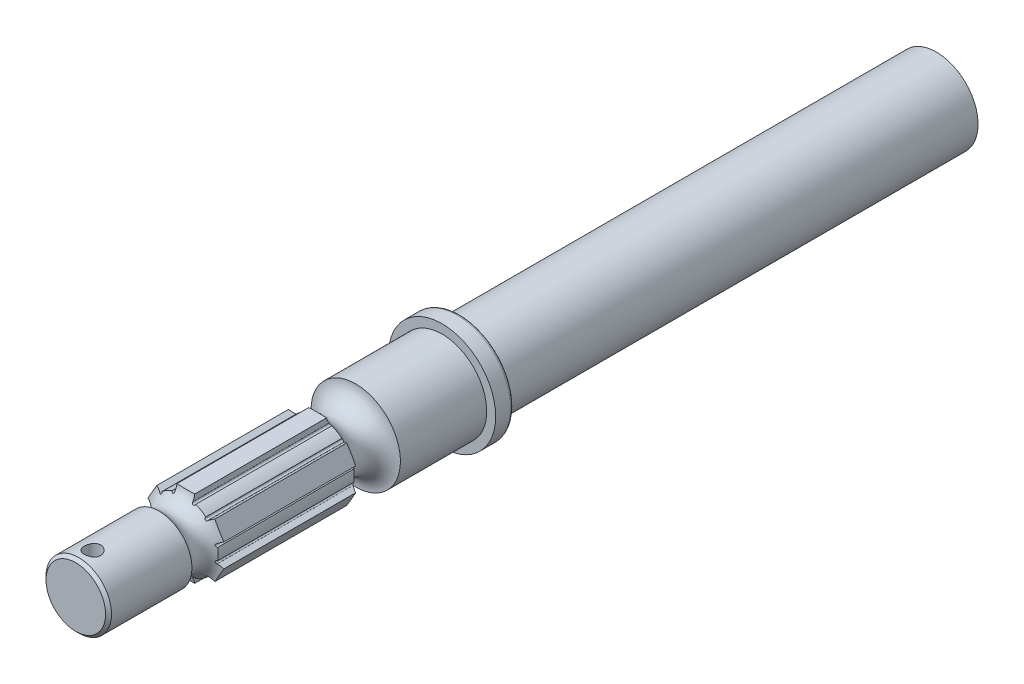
from build123d import *

# Parameters (mm, degrees)
ESQUISSE1_R                  = 14
EXTRUSION1_DEPTH             = 60
ESQUISSE2_R                  = 18
EXTRUSION2_DEPTH             = 6
ESQUISSE3_R                  = 15
EXTRUSION3_DEPTH             = 29
ESQUISSE5_OUTSIDE_W          = 61.88
ESQUISSE5_OUTSIDE_H          = 61.88
ESQUISSE5_OUTSIDE_R          = 14
ENL_V_MAT_EXTRU_1_DEPTH      = 5
ESQUISSE9_R                  = 14
EXTRUSION5_DEPTH             = 44
ENL_V_START                  = -34
ENL_V_MAT_EXTRU_4_DEPTH      = 58
ESQUISSE12_R                 = 0.5
ENL_V_MAT_EXTRU_5_DEPTH      = 58
R_P_TITION_CIRCULAIRE2_COUNT = 6
CHANFREIN1_SIZE              = 1
CONG_1_R                     = 1
EXTRUSION6_START             = 100
ESQUISSE13_R                 = 14
EXTRUSION6_DEPTH             = 100
ENL_V_MAT_EXTRU_6_DEPTH      = 191.706580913
ENL_V_MAT_EXTRU_6_DEPTH_BACK = 191.706580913
ESQUISSE14_R                 = 2.75


with BuildPart() as part:
    # Esquisse1 → Extrusion1 (new body)
    with BuildSketch(Plane.XY):
        Circle(ESQUISSE1_R)
    extrude(amount=EXTRUSION1_DEPTH)

    # Esquisse2 → Extrusion2 (add)
    with BuildSketch(Plane.XY.offset(60)):
        Circle(ESQUISSE2_R)
    extrude(amount=EXTRUSION2_DEPTH)

    # Esquisse3 → Extrusion3 (add)
    with BuildSketch(Plane.XY.offset(66)):
        with Locations(Location((0, 0, 0), (0, 0, 180))):
            Circle(ESQUISSE3_R)
    extrude(amount=EXTRUSION3_DEPTH)

    # Esquisse4 → R_volution1 (revolve)
    with BuildSketch(Plane(origin=(0, 0, 0), x_dir=(1, 0, 0), z_dir=(0, 1, 0)), mode=Mode.PRIVATE) as r_volution1_sk:
        with BuildLine():
            Line((15, -95), (0, -95))
            Line((0, -95), (0, -108))
            Line((0, -108), (15, -108))
            ThreePointArc((15, -108), (8.5, -101.5), (15, -95))
        make_face()
    revolve(r_volution1_sk.sketch.rotate(Axis((0, 0, 0), (0, 0, 1)), 180), axis=Axis((0, 0, 0), (0, 0, 1)))

    # Esquisse5 outside → Enl_v. mat.-Extru.1 (cut)
    with BuildSketch(Plane.XY.offset(108)):
        Rectangle(ESQUISSE5_OUTSIDE_W, ESQUISSE5_OUTSIDE_H)
        Circle(ESQUISSE5_OUTSIDE_R, mode=Mode.SUBTRACT)
    extrude(amount=-ENL_V_MAT_EXTRU_1_DEPTH, mode=Mode.SUBTRACT)

    # Esquisse9 → Extrusion5 (add)
    with BuildSketch(Plane.XY.offset(108)):
        Circle(ESQUISSE9_R)
    extrude(amount=EXTRUSION5_DEPTH)

    # Esquisse10 → R_volution2 (revolve)
    with BuildSketch(Plane(origin=(0, 0, 0), x_dir=(0, 0, -1), z_dir=(1, 0, 0)), mode=Mode.PRIVATE) as r_volution2_sk:
        with BuildLine():
            Line((-189, 0), (-189, 11))
            Line((-189, 11), (-161, 11))
            ThreePointArc((-161, 11), (-155.41886117, 9.25658351), (-152, 14))
            Line((-152, 14), (-152, 0))
            Line((-152, 0), (-189, 0))
        make_face()
    revolve(r_volution2_sk.sketch.rotate(Axis((0, 0, 0), (0, 0, 1)), 90), axis=Axis((0, 0, 0), (0, 0, 1)))

    # Esquisse11 → Enl_v. mat.-Extru.4 (cut)
    with BuildSketch(Plane.XY.offset(139).offset(ENL_V_START)):
        with BuildLine():
            Line((0, 13), (-3, 13))
            Line((-3, 13), (-3, 11.101801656))
            ThreePointArc((-3, 11.101801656), (-5.75, 9.959292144), (-8.114442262, 8.148977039))
            Line((-8.114442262, 8.148977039), (-9.758330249, 9.098076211))
            Line((-9.758330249, 9.098076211), (-11.258330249, 6.5))
            Line((-11.258330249, 6.5), (-12.124355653, 7))
            ThreePointArc((-12.124355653, 7), (-7, 12.124355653), (0, 14))
            Line((0, 14), (0, 13))
        make_face()
    enl_v_mat_extru_4 = extrude(amount=ENL_V_MAT_EXTRU_4_DEPTH, mode=Mode.SUBTRACT)

    # Esquisse12 → Enl_v. mat.-Extru.5 (cut)
    with BuildSketch(Plane.XY.offset(139).offset(ENL_V_START)):
        with Locations((-3.5, 10.95445115)):
            Circle(ESQUISSE12_R)
        with Locations((-7.736832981, 8.508314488)):
            Circle(ESQUISSE12_R)
    enl_v_mat_extru_5 = extrude(amount=ENL_V_MAT_EXTRU_5_DEPTH, mode=Mode.SUBTRACT)

    # R_p_tition circulaire2: Enl_v. mat.-Extru.4, Enl_v. mat.-Extru.5 ×6 about axis
    r_p_tition_circulaire2_axis = Axis((0, 0, 0), (0, 0, 1))
    add([enl_v_mat_extru_4.rotate(r_p_tition_circulaire2_axis, i * 360 / R_P_TITION_CIRCULAIRE2_COUNT) for i in range(1, R_P_TITION_CIRCULAIRE2_COUNT)], mode=Mode.SUBTRACT)
    add([enl_v_mat_extru_5.rotate(r_p_tition_circulaire2_axis, i * 360 / R_P_TITION_CIRCULAIRE2_COUNT) for i in range(1, R_P_TITION_CIRCULAIRE2_COUNT)], mode=Mode.SUBTRACT)

    # Chanfrein1
    chanfrein1_edges = [part.edges().sort_by_distance(p)[0] for p in [
        (11, 0, 189),
    ]]
    chamfer(chanfrein1_edges, length=CHANFREIN1_SIZE)

    # Cong_1
    cong_1_edges = [part.edges().sort_by_distance(p)[0] for p in [
        (-14, 0, 60),
        (-18, 0, 60),
    ]]
    fillet(cong_1_edges, radius=CONG_1_R)

    # Esquisse13 → Extrusion6 (add)
    with BuildSketch(Plane(origin=(0, 0, 0), x_dir=(-1, 0, 0), z_dir=(0, 0, -1)).offset(EXTRUSION6_START)):
        Circle(ESQUISSE13_R)
    extrude(amount=-EXTRUSION6_DEPTH)

    # Esquisse14 → Enl_v. mat.-Extru.6 (cut, two sides: drawn at the far end of the back side and taken through both)
    with BuildSketch(Plane(origin=(0, 0, 0), x_dir=(1, 0, 0), z_dir=(0, 1, 0)).offset(-ENL_V_MAT_EXTRU_6_DEPTH_BACK)):
        with Locations(Location((0, -183.411101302, 0), (0, 0, 270))):
            Circle(ESQUISSE14_R)
    extrude(amount=ENL_V_MAT_EXTRU_6_DEPTH + ENL_V_MAT_EXTRU_6_DEPTH_BACK, mode=Mode.SUBTRACT)


solid = part.part
